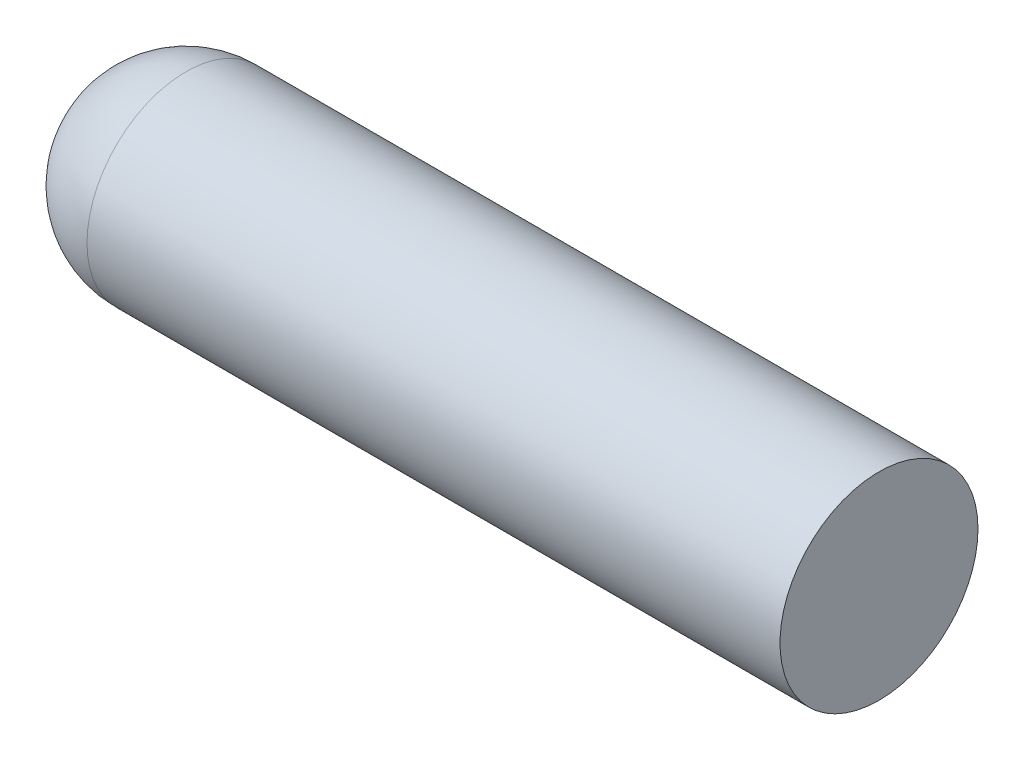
ISO-10303-21;
HEADER;
FILE_DESCRIPTION(('STEP AP214'),'2;1');
FILE_NAME('part.step','',(''),(''),'','','');
FILE_SCHEMA(('AUTOMOTIVE_DESIGN { 1 0 10303 214 1 1 1 1 }'));
ENDSEC;
DATA;
#1=APPLICATION_CONTEXT('core data for automotive mechanical design processes');
#2=APPLICATION_PROTOCOL_DEFINITION('international standard','automotive_design',2000,#1);
#3=PRODUCT_CONTEXT('',#1,'mechanical');
#4=PRODUCT('Part','Part','',(#3));
#5=PRODUCT_RELATED_PRODUCT_CATEGORY('part','',(#4));
#6=PRODUCT_DEFINITION_FORMATION('','',#4);
#7=PRODUCT_DEFINITION_CONTEXT('part definition',#1,'design');
#8=PRODUCT_DEFINITION('design','',#6,#7);
#9=PRODUCT_DEFINITION_SHAPE('','',#8);
#10=(LENGTH_UNIT() NAMED_UNIT(*) SI_UNIT(.MILLI.,.METRE.));
#11=(NAMED_UNIT(*) PLANE_ANGLE_UNIT() SI_UNIT($,.RADIAN.));
#12=(NAMED_UNIT(*) SI_UNIT($,.STERADIAN.) SOLID_ANGLE_UNIT());
#13=UNCERTAINTY_MEASURE_WITH_UNIT(LENGTH_MEASURE(1.E-05),#10,'distance_accuracy_value','');
#14=(GEOMETRIC_REPRESENTATION_CONTEXT(3) GLOBAL_UNCERTAINTY_ASSIGNED_CONTEXT((#13)) GLOBAL_UNIT_ASSIGNED_CONTEXT((#10,
#11,#12)) REPRESENTATION_CONTEXT('',''));
#15=CARTESIAN_POINT('',(0.,0.,0.));
#16=DIRECTION('',(0.,0.,1.));
#17=DIRECTION('',(1.,0.,0.));
#18=AXIS2_PLACEMENT_3D('',#15,#16,#17);
#19=CARTESIAN_POINT('',(-29.3525,129.35,0.));
#20=DIRECTION('',(1.,0.,0.));
#21=DIRECTION('',(0.,1.,0.));
#22=AXIS2_PLACEMENT_3D('',#19,#20,#21);
#23=CYLINDRICAL_SURFACE('',#22,1.4925);
#24=CARTESIAN_POINT('',(-27.86,129.35,0.));
#25=DIRECTION('',(1.,0.,0.));
#26=DIRECTION('',(0.,0.,-1.));
#27=AXIS2_PLACEMENT_3D('',#24,#25,#26);
#28=CIRCLE('',#27,1.4925);
#29=CARTESIAN_POINT('',(-27.86,129.35,-1.49249999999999));
#30=VERTEX_POINT('',#29);
#31=EDGE_CURVE('E10',#30,#30,#28,.T.);
#32=ORIENTED_EDGE('',*,*,#31,.T.);
#33=EDGE_LOOP('',(#32));
#34=FACE_BOUND('',#33,.T.);
#35=CARTESIAN_POINT('',(-17.4125,129.35,0.));
#36=DIRECTION('',(-1.,0.,0.));
#37=DIRECTION('',(0.,-1.,0.));
#38=AXIS2_PLACEMENT_3D('',#35,#36,#37);
#39=CIRCLE('',#38,1.4925);
#40=CARTESIAN_POINT('',(-17.4125,127.8575,0.));
#41=VERTEX_POINT('',#40);
#42=EDGE_CURVE('E21',#41,#41,#39,.T.);
#43=ORIENTED_EDGE('',*,*,#42,.T.);
#44=EDGE_LOOP('',(#43));
#45=FACE_BOUND('',#44,.T.);
#46=ADVANCED_FACE('F14',(#34,#45),#23,.T.);
#47=CARTESIAN_POINT('',(-17.4125,129.35,0.));
#48=DIRECTION('',(-1.,0.,0.));
#49=DIRECTION('',(0.,-1.,0.));
#50=AXIS2_PLACEMENT_3D('',#47,#48,#49);
#51=PLANE('',#50);
#52=ORIENTED_EDGE('',*,*,#42,.F.);
#53=EDGE_LOOP('',(#52));
#54=FACE_BOUND('',#53,.T.);
#55=ADVANCED_FACE('F47',(#54),#51,.F.);
#56=CARTESIAN_POINT('',(-27.86,129.35,0.));
#57=DIRECTION('',(0.,0.,1.));
#58=DIRECTION('',(1.,0.,0.));
#59=AXIS2_PLACEMENT_3D('',#56,#57,#58);
#60=SPHERICAL_SURFACE('',#59,1.4925);
#61=CARTESIAN_POINT('',(-27.86,129.35,0.));
#62=DIRECTION('',(1.,0.,0.));
#63=DIRECTION('',(0.,0.,-1.));
#64=AXIS2_PLACEMENT_3D('',#61,#62,#63);
#65=SPHERICAL_SURFACE('',#64,1.4925);
#66=ORIENTED_EDGE('',*,*,#31,.F.);
#67=EDGE_LOOP('',(#66));
#68=FACE_BOUND('',#67,.T.);
#69=ADVANCED_FACE('F49',(#68),#65,.T.);
#70=CLOSED_SHELL('',(#46,#55,#69));
#71=MANIFOLD_SOLID_BREP('B1',#70);
#72=ADVANCED_BREP_SHAPE_REPRESENTATION('',(#18,#71),#14);
#73=SHAPE_DEFINITION_REPRESENTATION(#9,#72);
ENDSEC;
END-ISO-10303-21;
